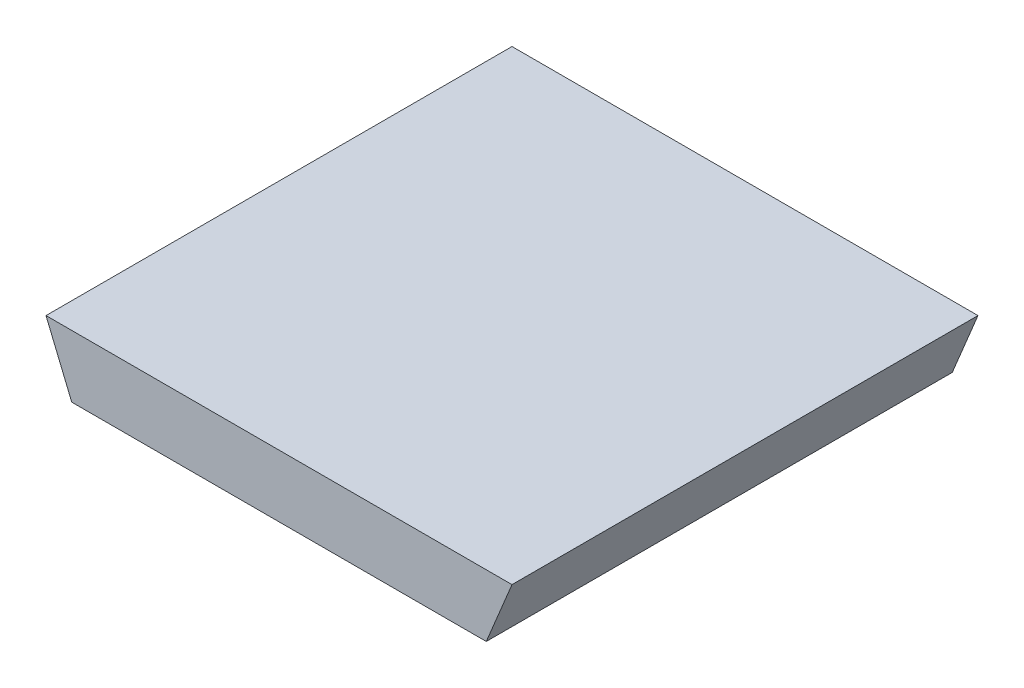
from build123d import *

# Parameters (mm, degrees)
AUFSATZ_LINEAR_AUSTRAGEN1_DEPTH = 15


with BuildPart() as part:
    # Skizze1 → Aufsatz-Linear austragen1 (new, symmetric)
    with BuildSketch(Plane.XY):
        Polygon((-15, 0), (15, 0), (13.343145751, -4), (-13.343145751, -4), align=None)
    extrude(amount=AUFSATZ_LINEAR_AUSTRAGEN1_DEPTH, both=True)


solid = part.part
